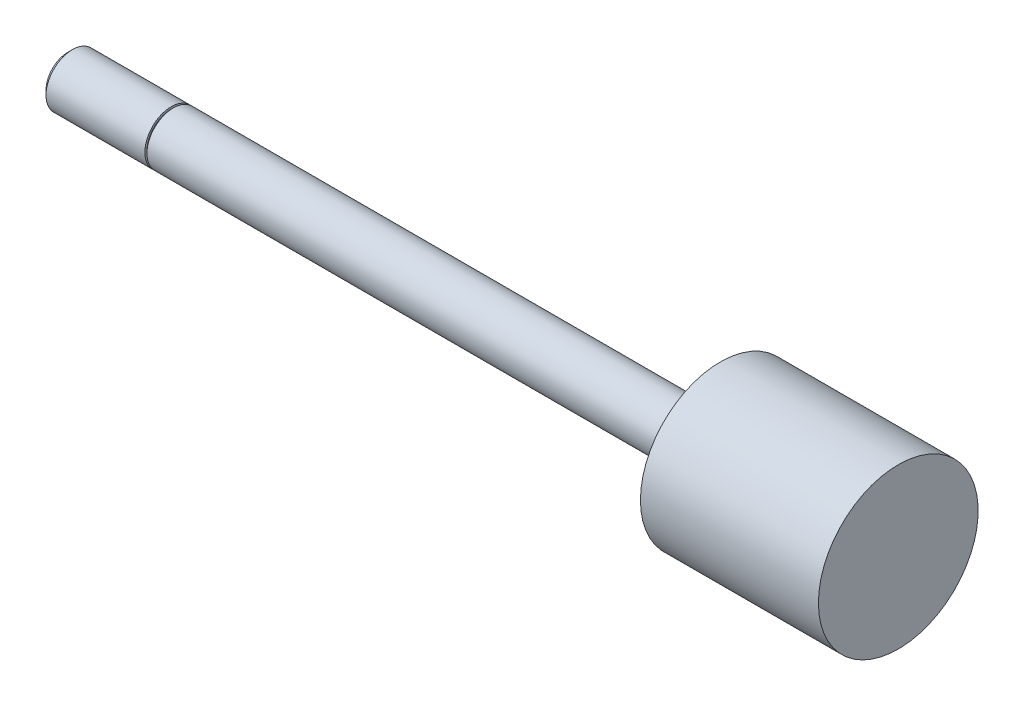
ISO-10303-21;
HEADER;
FILE_DESCRIPTION(('STEP AP214'),'2;1');
FILE_NAME('part.step','',(''),(''),'','','');
FILE_SCHEMA(('AUTOMOTIVE_DESIGN { 1 0 10303 214 1 1 1 1 }'));
ENDSEC;
DATA;
#1=APPLICATION_CONTEXT('core data for automotive mechanical design processes');
#2=APPLICATION_PROTOCOL_DEFINITION('international standard','automotive_design',2000,#1);
#3=PRODUCT_CONTEXT('',#1,'mechanical');
#4=PRODUCT('Part','Part','',(#3));
#5=PRODUCT_RELATED_PRODUCT_CATEGORY('part','',(#4));
#6=PRODUCT_DEFINITION_FORMATION('','',#4);
#7=PRODUCT_DEFINITION_CONTEXT('part definition',#1,'design');
#8=PRODUCT_DEFINITION('design','',#6,#7);
#9=PRODUCT_DEFINITION_SHAPE('','',#8);
#10=(LENGTH_UNIT() NAMED_UNIT(*) SI_UNIT(.MILLI.,.METRE.));
#11=(NAMED_UNIT(*) PLANE_ANGLE_UNIT() SI_UNIT($,.RADIAN.));
#12=(NAMED_UNIT(*) SI_UNIT($,.STERADIAN.) SOLID_ANGLE_UNIT());
#13=UNCERTAINTY_MEASURE_WITH_UNIT(LENGTH_MEASURE(1.E-05),#10,'distance_accuracy_value','');
#14=(GEOMETRIC_REPRESENTATION_CONTEXT(3) GLOBAL_UNCERTAINTY_ASSIGNED_CONTEXT((#13)) GLOBAL_UNIT_ASSIGNED_CONTEXT((#10,
#11,#12)) REPRESENTATION_CONTEXT('',''));
#15=CARTESIAN_POINT('',(0.,0.,0.));
#16=DIRECTION('',(0.,0.,1.));
#17=DIRECTION('',(1.,0.,0.));
#18=AXIS2_PLACEMENT_3D('',#15,#16,#17);
#19=CARTESIAN_POINT('',(-12.7,0.,0.));
#20=DIRECTION('',(1.,0.,0.));
#21=DIRECTION('',(0.,0.,-1.));
#22=AXIS2_PLACEMENT_3D('',#19,#20,#21);
#23=PLANE('',#22);
#24=CARTESIAN_POINT('',(-12.6999999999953,0.,0.));
#25=DIRECTION('',(1.,0.,0.));
#26=DIRECTION('',(0.,0.,-1.));
#27=AXIS2_PLACEMENT_3D('',#24,#25,#26);
#28=CIRCLE('',#27,2.63398000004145);
#29=CARTESIAN_POINT('',(-12.6999999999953,0.,-2.63398000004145));
#30=VERTEX_POINT('',#29);
#31=EDGE_CURVE('E26',#30,#30,#28,.T.);
#32=ORIENTED_EDGE('',*,*,#31,.F.);
#33=EDGE_LOOP('',(#32));
#34=FACE_BOUND('',#33,.T.);
#35=ADVANCED_FACE('F23',(#34),#23,.F.);
#36=CARTESIAN_POINT('',(-12.1589799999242,0.,0.));
#37=DIRECTION('',(1.,0.,0.));
#38=DIRECTION('',(0.,0.,-1.));
#39=AXIS2_PLACEMENT_3D('',#36,#37,#38);
#40=CONICAL_SURFACE('',#39,3.1750000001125,0.785398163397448);
#41=ORIENTED_EDGE('',*,*,#31,.T.);
#42=EDGE_LOOP('',(#41));
#43=FACE_BOUND('',#42,.T.);
#44=CARTESIAN_POINT('',(-12.15898,0.,0.));
#45=DIRECTION('',(-1.,0.,0.));
#46=DIRECTION('',(0.,0.,1.));
#47=AXIS2_PLACEMENT_3D('',#44,#45,#46);
#48=CIRCLE('',#47,3.175);
#49=CARTESIAN_POINT('',(-12.15898,0.,3.175));
#50=VERTEX_POINT('',#49);
#51=EDGE_CURVE('E53',#50,#50,#48,.F.);
#52=ORIENTED_EDGE('',*,*,#51,.F.);
#53=EDGE_LOOP('',(#52));
#54=FACE_BOUND('',#53,.T.);
#55=ADVANCED_FACE('F62',(#43,#54),#40,.T.);
#56=CARTESIAN_POINT('',(87.3252,0.,0.));
#57=DIRECTION('',(-1.,0.,0.));
#58=DIRECTION('',(0.,0.,1.));
#59=AXIS2_PLACEMENT_3D('',#56,#57,#58);
#60=CYLINDRICAL_SURFACE('',#59,3.175);
#61=ORIENTED_EDGE('',*,*,#51,.T.);
#62=EDGE_LOOP('',(#61));
#63=FACE_BOUND('',#62,.T.);
#64=CARTESIAN_POINT('',(-0.254000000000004,0.,0.));
#65=DIRECTION('',(-1.,0.,0.));
#66=DIRECTION('',(0.,0.,1.));
#67=AXIS2_PLACEMENT_3D('',#64,#65,#66);
#68=CIRCLE('',#67,3.175);
#69=CARTESIAN_POINT('',(-0.254000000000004,0.,3.175));
#70=VERTEX_POINT('',#69);
#71=EDGE_CURVE('E51',#70,#70,#68,.T.);
#72=ORIENTED_EDGE('',*,*,#71,.T.);
#73=EDGE_LOOP('',(#72));
#74=FACE_BOUND('',#73,.T.);
#75=ADVANCED_FACE('F70',(#63,#74),#60,.T.);
#76=CARTESIAN_POINT('',(87.3252,9.62025,0.));
#77=DIRECTION('',(-1.,0.,0.));
#78=DIRECTION('',(0.,0.,1.));
#79=AXIS2_PLACEMENT_3D('',#76,#77,#78);
#80=PLANE('',#79);
#81=CARTESIAN_POINT('',(87.3252,0.,0.));
#82=DIRECTION('',(-1.,0.,0.));
#83=DIRECTION('',(0.,0.,1.));
#84=AXIS2_PLACEMENT_3D('',#81,#82,#83);
#85=CIRCLE('',#84,9.62025);
#86=CARTESIAN_POINT('',(87.3252,0.,9.62025));
#87=VERTEX_POINT('',#86);
#88=EDGE_CURVE('E49',#87,#87,#85,.T.);
#89=ORIENTED_EDGE('',*,*,#88,.F.);
#90=EDGE_LOOP('',(#89));
#91=FACE_BOUND('',#90,.T.);
#92=ADVANCED_FACE('F97',(#91),#80,.F.);
#93=CARTESIAN_POINT('',(-0.254,3.429,0.));
#94=DIRECTION('',(-1.,0.,0.));
#95=DIRECTION('',(0.,0.,1.));
#96=AXIS2_PLACEMENT_3D('',#93,#94,#95);
#97=PLANE('',#96);
#98=ORIENTED_EDGE('',*,*,#71,.F.);
#99=EDGE_LOOP('',(#98));
#100=FACE_BOUND('',#99,.T.);
#101=CARTESIAN_POINT('',(-0.254,0.,0.));
#102=DIRECTION('',(-1.,0.,0.));
#103=DIRECTION('',(0.,0.,1.));
#104=AXIS2_PLACEMENT_3D('',#101,#102,#103);
#105=CIRCLE('',#104,2.921);
#106=CARTESIAN_POINT('',(-0.254,0.,2.921));
#107=VERTEX_POINT('',#106);
#108=EDGE_CURVE('E46',#107,#107,#105,.F.);
#109=ORIENTED_EDGE('',*,*,#108,.F.);
#110=EDGE_LOOP('',(#109));
#111=FACE_BOUND('',#110,.T.);
#112=ADVANCED_FACE('F93',(#100,#111),#97,.F.);
#113=CARTESIAN_POINT('',(87.3252,0.,0.));
#114=DIRECTION('',(-1.,0.,0.));
#115=DIRECTION('',(0.,0.,1.));
#116=AXIS2_PLACEMENT_3D('',#113,#114,#115);
#117=CYLINDRICAL_SURFACE('',#116,9.62025);
#118=CARTESIAN_POINT('',(65.8876,0.,0.));
#119=DIRECTION('',(-1.,0.,0.));
#120=DIRECTION('',(0.,0.,1.));
#121=AXIS2_PLACEMENT_3D('',#118,#119,#120);
#122=CIRCLE('',#121,9.62025);
#123=CARTESIAN_POINT('',(65.8876,0.,9.62025));
#124=VERTEX_POINT('',#123);
#125=EDGE_CURVE('E43',#124,#124,#122,.F.);
#126=ORIENTED_EDGE('',*,*,#125,.T.);
#127=EDGE_LOOP('',(#126));
#128=FACE_BOUND('',#127,.T.);
#129=ORIENTED_EDGE('',*,*,#88,.T.);
#130=EDGE_LOOP('',(#129));
#131=FACE_BOUND('',#130,.T.);
#132=ADVANCED_FACE('F89',(#128,#131),#117,.T.);
#133=CARTESIAN_POINT('',(0.,0.,0.));
#134=DIRECTION('',(-1.,0.,0.));
#135=DIRECTION('',(0.,0.,1.));
#136=AXIS2_PLACEMENT_3D('',#133,#134,#135);
#137=CYLINDRICAL_SURFACE('',#136,2.921);
#138=ORIENTED_EDGE('',*,*,#108,.T.);
#139=EDGE_LOOP('',(#138));
#140=FACE_BOUND('',#139,.T.);
#141=CARTESIAN_POINT('',(0.,0.,0.));
#142=DIRECTION('',(-1.,0.,0.));
#143=DIRECTION('',(0.,0.,1.));
#144=AXIS2_PLACEMENT_3D('',#141,#142,#143);
#145=CIRCLE('',#144,2.921);
#146=CARTESIAN_POINT('',(0.,0.,2.921));
#147=VERTEX_POINT('',#146);
#148=EDGE_CURVE('E35',#147,#147,#145,.T.);
#149=ORIENTED_EDGE('',*,*,#148,.T.);
#150=EDGE_LOOP('',(#149));
#151=FACE_BOUND('',#150,.T.);
#152=ADVANCED_FACE('F85',(#140,#151),#137,.T.);
#153=CARTESIAN_POINT('',(65.8876,3.175,0.));
#154=DIRECTION('',(1.,0.,0.));
#155=DIRECTION('',(0.,0.,-1.));
#156=AXIS2_PLACEMENT_3D('',#153,#154,#155);
#157=PLANE('',#156);
#158=CARTESIAN_POINT('',(65.8876,0.,0.));
#159=DIRECTION('',(-1.,0.,0.));
#160=DIRECTION('',(0.,0.,1.));
#161=AXIS2_PLACEMENT_3D('',#158,#159,#160);
#162=CIRCLE('',#161,3.175);
#163=CARTESIAN_POINT('',(65.8876,0.,3.175));
#164=VERTEX_POINT('',#163);
#165=EDGE_CURVE('E30',#164,#164,#162,.T.);
#166=ORIENTED_EDGE('',*,*,#165,.F.);
#167=EDGE_LOOP('',(#166));
#168=FACE_BOUND('',#167,.T.);
#169=ORIENTED_EDGE('',*,*,#125,.F.);
#170=EDGE_LOOP('',(#169));
#171=FACE_BOUND('',#170,.T.);
#172=ADVANCED_FACE('F78',(#168,#171),#157,.F.);
#173=CARTESIAN_POINT('',(0.,2.921,0.));
#174=DIRECTION('',(1.,0.,0.));
#175=DIRECTION('',(0.,0.,-1.));
#176=AXIS2_PLACEMENT_3D('',#173,#174,#175);
#177=PLANE('',#176);
#178=ORIENTED_EDGE('',*,*,#148,.F.);
#179=EDGE_LOOP('',(#178));
#180=FACE_BOUND('',#179,.T.);
#181=CARTESIAN_POINT('',(0.,0.,0.));
#182=DIRECTION('',(-1.,0.,0.));
#183=DIRECTION('',(0.,0.,1.));
#184=AXIS2_PLACEMENT_3D('',#181,#182,#183);
#185=CIRCLE('',#184,3.175);
#186=CARTESIAN_POINT('',(0.,0.,3.175));
#187=VERTEX_POINT('',#186);
#188=EDGE_CURVE('E12',#187,#187,#185,.F.);
#189=ORIENTED_EDGE('',*,*,#188,.F.);
#190=EDGE_LOOP('',(#189));
#191=FACE_BOUND('',#190,.T.);
#192=ADVANCED_FACE('F73',(#180,#191),#177,.F.);
#193=CARTESIAN_POINT('',(87.3252,0.,0.));
#194=DIRECTION('',(-1.,0.,0.));
#195=DIRECTION('',(0.,0.,1.));
#196=AXIS2_PLACEMENT_3D('',#193,#194,#195);
#197=CYLINDRICAL_SURFACE('',#196,3.175);
#198=ORIENTED_EDGE('',*,*,#188,.T.);
#199=EDGE_LOOP('',(#198));
#200=FACE_BOUND('',#199,.T.);
#201=ORIENTED_EDGE('',*,*,#165,.T.);
#202=EDGE_LOOP('',(#201));
#203=FACE_BOUND('',#202,.T.);
#204=ADVANCED_FACE('F71',(#200,#203),#197,.T.);
#205=CLOSED_SHELL('',(#35,#55,#75,#92,#112,#132,#152,#172,#192,#204));
#206=MANIFOLD_SOLID_BREP('B1',#205);
#207=ADVANCED_BREP_SHAPE_REPRESENTATION('',(#18,#206),#14);
#208=SHAPE_DEFINITION_REPRESENTATION(#9,#207);
ENDSEC;
END-ISO-10303-21;
